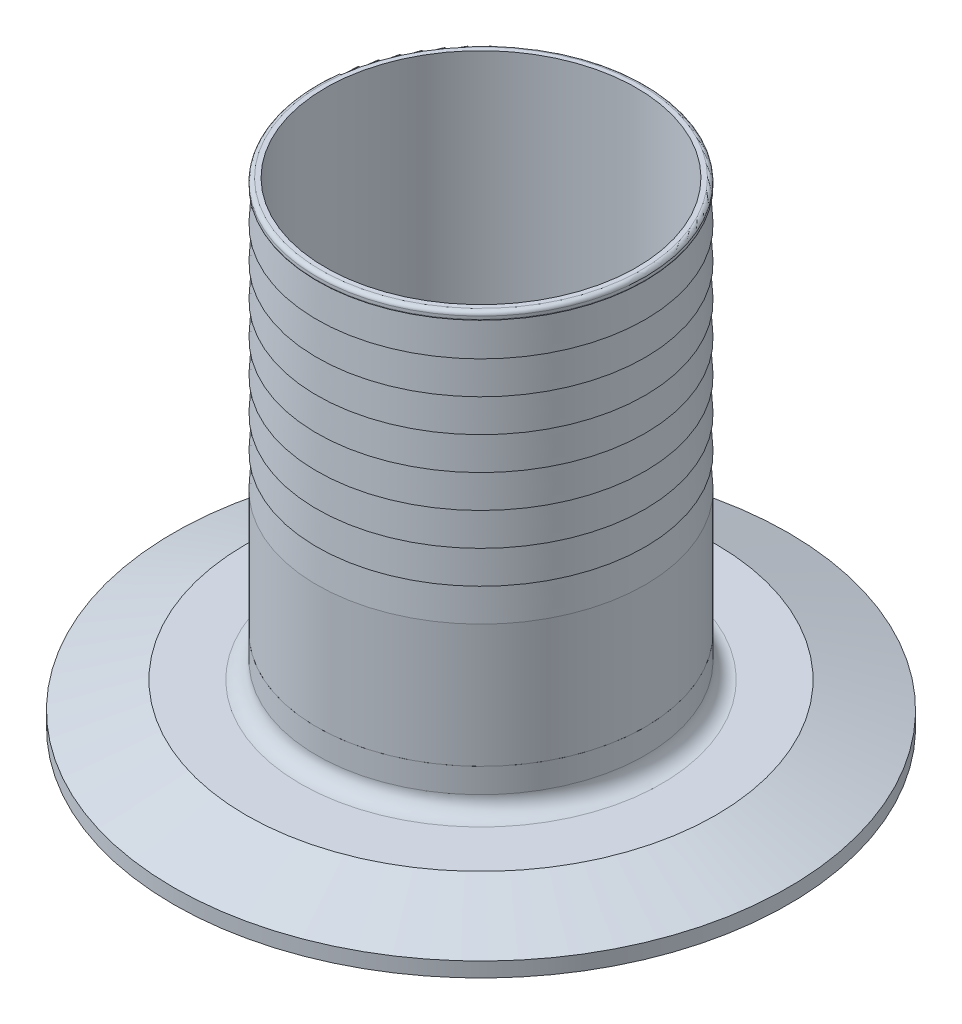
ISO-10303-21;
HEADER;
FILE_DESCRIPTION(('STEP AP214'),'2;1');
FILE_NAME('part.step','',(''),(''),'','','');
FILE_SCHEMA(('AUTOMOTIVE_DESIGN { 1 0 10303 214 1 1 1 1 }'));
ENDSEC;
DATA;
#1=APPLICATION_CONTEXT('core data for automotive mechanical design processes');
#2=APPLICATION_PROTOCOL_DEFINITION('international standard','automotive_design',2000,#1);
#3=PRODUCT_CONTEXT('',#1,'mechanical');
#4=PRODUCT('Part','Part','',(#3));
#5=PRODUCT_RELATED_PRODUCT_CATEGORY('part','',(#4));
#6=PRODUCT_DEFINITION_FORMATION('','',#4);
#7=PRODUCT_DEFINITION_CONTEXT('part definition',#1,'design');
#8=PRODUCT_DEFINITION('design','',#6,#7);
#9=PRODUCT_DEFINITION_SHAPE('','',#8);
#10=(LENGTH_UNIT() NAMED_UNIT(*) SI_UNIT(.MILLI.,.METRE.));
#11=(NAMED_UNIT(*) PLANE_ANGLE_UNIT() SI_UNIT($,.RADIAN.));
#12=(NAMED_UNIT(*) SI_UNIT($,.STERADIAN.) SOLID_ANGLE_UNIT());
#13=UNCERTAINTY_MEASURE_WITH_UNIT(LENGTH_MEASURE(1.E-05),#10,'distance_accuracy_value','');
#14=(GEOMETRIC_REPRESENTATION_CONTEXT(3) GLOBAL_UNCERTAINTY_ASSIGNED_CONTEXT((#13)) GLOBAL_UNIT_ASSIGNED_CONTEXT((#10,
#11,#12)) REPRESENTATION_CONTEXT('',''));
#15=CARTESIAN_POINT('',(0.,0.,0.));
#16=DIRECTION('',(0.,0.,1.));
#17=DIRECTION('',(1.,0.,0.));
#18=AXIS2_PLACEMENT_3D('',#15,#16,#17);
#19=CARTESIAN_POINT('',(89.1797478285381,79.9037281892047,85.2123361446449));
#20=DIRECTION('',(0.,-1.,0.));
#21=DIRECTION('',(0.0688647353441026,0.,-0.997626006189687));
#22=AXIS2_PLACEMENT_3D('',#19,#20,#21);
#23=PLANE('',#22);
#24=CARTESIAN_POINT('',(57.5051221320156,79.9037281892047,83.0258807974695));
#25=DIRECTION('',(0.,-1.,0.));
#26=DIRECTION('',(0.0688647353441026,0.,-0.997626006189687));
#27=AXIS2_PLACEMENT_3D('',#24,#25,#26);
#28=CIRCLE('',#27,30.099);
#29=CARTESIAN_POINT('',(59.5778818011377,79.9037281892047,52.9983356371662));
#30=VERTEX_POINT('',#29);
#31=EDGE_CURVE('P0_E85',#30,#30,#28,.T.);
#32=ORIENTED_EDGE('',*,*,#31,.F.);
#33=EDGE_LOOP('',(#32));
#34=FACE_BOUND('',#33,.T.);
#35=CARTESIAN_POINT('',(57.5051221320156,79.9037281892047,83.0258807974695));
#36=DIRECTION('',(0.,-1.,0.));
#37=DIRECTION('',(0.0688647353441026,0.,-0.997626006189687));
#38=AXIS2_PLACEMENT_3D('',#35,#36,#37);
#39=CIRCLE('',#38,31.75);
#40=CARTESIAN_POINT('',(59.6915774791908,79.9037281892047,51.351255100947));
#41=VERTEX_POINT('',#40);
#42=EDGE_CURVE('P0_E9',#41,#41,#39,.T.);
#43=ORIENTED_EDGE('',*,*,#42,.T.);
#44=EDGE_LOOP('',(#43));
#45=FACE_BOUND('',#44,.T.);
#46=ADVANCED_FACE('P0_F14',(#34,#45),#23,.T.);
#47=CARTESIAN_POINT('',(57.5051221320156,79.9037281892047,83.0258807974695));
#48=DIRECTION('',(0.,-1.,0.));
#49=DIRECTION('',(0.0688647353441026,0.,-0.997626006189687));
#50=AXIS2_PLACEMENT_3D('',#47,#48,#49);
#51=CYLINDRICAL_SURFACE('',#50,31.75);
#52=CARTESIAN_POINT('',(57.5051221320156,103.728928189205,83.0258807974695));
#53=DIRECTION('',(0.,-1.,0.));
#54=DIRECTION('',(0.0688647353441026,0.,-0.997626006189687));
#55=AXIS2_PLACEMENT_3D('',#52,#53,#54);
#56=CIRCLE('',#55,31.75);
#57=CARTESIAN_POINT('',(59.6915774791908,103.728928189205,51.351255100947));
#58=VERTEX_POINT('',#57);
#59=EDGE_CURVE('P0_E20',#58,#58,#56,.T.);
#60=ORIENTED_EDGE('',*,*,#59,.T.);
#61=EDGE_LOOP('',(#60));
#62=FACE_BOUND('',#61,.T.);
#63=ORIENTED_EDGE('',*,*,#42,.F.);
#64=EDGE_LOOP('',(#63));
#65=FACE_BOUND('',#64,.T.);
#66=ADVANCED_FACE('P0_F101',(#62,#65),#51,.T.);
#67=CARTESIAN_POINT('',(57.5051221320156,103.728928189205,83.0258807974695));
#68=DIRECTION('',(0.,-1.,0.));
#69=DIRECTION('',(0.0688647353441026,0.,-0.997626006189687));
#70=AXIS2_PLACEMENT_3D('',#67,#68,#69);
#71=CONICAL_SURFACE('',#70,31.75,0.0599281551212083);
#72=CARTESIAN_POINT('',(57.5051221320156,110.078928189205,83.0258807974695));
#73=DIRECTION('',(0.,-1.,0.));
#74=DIRECTION('',(0.0688647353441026,0.,-0.997626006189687));
#75=AXIS2_PLACEMENT_3D('',#72,#73,#74);
#76=CIRCLE('',#75,31.369);
#77=CARTESIAN_POINT('',(59.6653400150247,110.078928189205,51.7313506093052));
#78=VERTEX_POINT('',#77);
#79=EDGE_CURVE('P0_E24',#78,#78,#76,.T.);
#80=ORIENTED_EDGE('',*,*,#79,.T.);
#81=EDGE_LOOP('',(#80));
#82=FACE_BOUND('',#81,.T.);
#83=ORIENTED_EDGE('',*,*,#59,.F.);
#84=EDGE_LOOP('',(#83));
#85=FACE_BOUND('',#84,.T.);
#86=ADVANCED_FACE('P0_F106',(#82,#85),#71,.T.);
#87=CARTESIAN_POINT('',(89.1797478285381,110.078928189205,85.2123361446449));
#88=DIRECTION('',(0.,-1.,0.));
#89=DIRECTION('',(0.0688647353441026,0.,-0.997626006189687));
#90=AXIS2_PLACEMENT_3D('',#87,#88,#89);
#91=PLANE('',#90);
#92=CARTESIAN_POINT('',(57.5051221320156,110.078928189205,83.0258807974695));
#93=DIRECTION('',(0.,-1.,0.));
#94=DIRECTION('',(0.0688647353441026,0.,-0.997626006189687));
#95=AXIS2_PLACEMENT_3D('',#92,#93,#94);
#96=CIRCLE('',#95,31.75);
#97=CARTESIAN_POINT('',(59.6915774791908,110.078928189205,51.351255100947));
#98=VERTEX_POINT('',#97);
#99=EDGE_CURVE('P0_E28',#98,#98,#96,.T.);
#100=ORIENTED_EDGE('',*,*,#99,.T.);
#101=EDGE_LOOP('',(#100));
#102=FACE_BOUND('',#101,.T.);
#103=ORIENTED_EDGE('',*,*,#79,.F.);
#104=EDGE_LOOP('',(#103));
#105=FACE_BOUND('',#104,.T.);
#106=ADVANCED_FACE('P0_F110',(#102,#105),#91,.T.);
#107=CARTESIAN_POINT('',(57.5051221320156,110.078928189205,83.0258807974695));
#108=DIRECTION('',(0.,-1.,0.));
#109=DIRECTION('',(0.0688647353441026,0.,-0.997626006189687));
#110=AXIS2_PLACEMENT_3D('',#107,#108,#109);
#111=CONICAL_SURFACE('',#110,31.75,0.0599281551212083);
#112=CARTESIAN_POINT('',(57.5051221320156,116.428928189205,83.0258807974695));
#113=DIRECTION('',(0.,-1.,0.));
#114=DIRECTION('',(0.0688647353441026,0.,-0.997626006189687));
#115=AXIS2_PLACEMENT_3D('',#112,#113,#114);
#116=CIRCLE('',#115,31.369);
#117=CARTESIAN_POINT('',(59.6653400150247,116.428928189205,51.7313506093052));
#118=VERTEX_POINT('',#117);
#119=EDGE_CURVE('P0_E33',#118,#118,#116,.T.);
#120=ORIENTED_EDGE('',*,*,#119,.T.);
#121=EDGE_LOOP('',(#120));
#122=FACE_BOUND('',#121,.T.);
#123=ORIENTED_EDGE('',*,*,#99,.F.);
#124=EDGE_LOOP('',(#123));
#125=FACE_BOUND('',#124,.T.);
#126=ADVANCED_FACE('P0_F117',(#122,#125),#111,.T.);
#127=CARTESIAN_POINT('',(89.1797478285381,116.428928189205,85.2123361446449));
#128=DIRECTION('',(0.,-1.,0.));
#129=DIRECTION('',(0.0688647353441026,0.,-0.997626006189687));
#130=AXIS2_PLACEMENT_3D('',#127,#128,#129);
#131=PLANE('',#130);
#132=CARTESIAN_POINT('',(57.5051221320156,116.428928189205,83.0258807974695));
#133=DIRECTION('',(0.,-1.,0.));
#134=DIRECTION('',(0.0688647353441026,0.,-0.997626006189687));
#135=AXIS2_PLACEMENT_3D('',#132,#133,#134);
#136=CIRCLE('',#135,31.75);
#137=CARTESIAN_POINT('',(59.6915774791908,116.428928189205,51.351255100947));
#138=VERTEX_POINT('',#137);
#139=EDGE_CURVE('P0_E36',#138,#138,#136,.T.);
#140=ORIENTED_EDGE('',*,*,#139,.T.);
#141=EDGE_LOOP('',(#140));
#142=FACE_BOUND('',#141,.T.);
#143=ORIENTED_EDGE('',*,*,#119,.F.);
#144=EDGE_LOOP('',(#143));
#145=FACE_BOUND('',#144,.T.);
#146=ADVANCED_FACE('P0_F121',(#142,#145),#131,.T.);
#147=CARTESIAN_POINT('',(57.5051221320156,116.428928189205,83.0258807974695));
#148=DIRECTION('',(0.,-1.,0.));
#149=DIRECTION('',(0.0688647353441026,0.,-0.997626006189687));
#150=AXIS2_PLACEMENT_3D('',#147,#148,#149);
#151=CONICAL_SURFACE('',#150,31.75,0.0599281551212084);
#152=CARTESIAN_POINT('',(57.5051221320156,122.778928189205,83.0258807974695));
#153=DIRECTION('',(0.,-1.,0.));
#154=DIRECTION('',(0.0688647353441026,0.,-0.997626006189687));
#155=AXIS2_PLACEMENT_3D('',#152,#153,#154);
#156=CIRCLE('',#155,31.369);
#157=CARTESIAN_POINT('',(59.6653400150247,122.778928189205,51.7313506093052));
#158=VERTEX_POINT('',#157);
#159=EDGE_CURVE('P0_E39',#158,#158,#156,.T.);
#160=ORIENTED_EDGE('',*,*,#159,.T.);
#161=EDGE_LOOP('',(#160));
#162=FACE_BOUND('',#161,.T.);
#163=ORIENTED_EDGE('',*,*,#139,.F.);
#164=EDGE_LOOP('',(#163));
#165=FACE_BOUND('',#164,.T.);
#166=ADVANCED_FACE('P0_F125',(#162,#165),#151,.T.);
#167=CARTESIAN_POINT('',(89.1797478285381,122.778928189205,85.2123361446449));
#168=DIRECTION('',(0.,-1.,0.));
#169=DIRECTION('',(0.0688647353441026,0.,-0.997626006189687));
#170=AXIS2_PLACEMENT_3D('',#167,#168,#169);
#171=PLANE('',#170);
#172=CARTESIAN_POINT('',(57.5051221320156,122.778928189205,83.0258807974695));
#173=DIRECTION('',(0.,-1.,0.));
#174=DIRECTION('',(0.0688647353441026,0.,-0.997626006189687));
#175=AXIS2_PLACEMENT_3D('',#172,#173,#174);
#176=CIRCLE('',#175,31.75);
#177=CARTESIAN_POINT('',(59.6915774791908,122.778928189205,51.351255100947));
#178=VERTEX_POINT('',#177);
#179=EDGE_CURVE('P0_E42',#178,#178,#176,.T.);
#180=ORIENTED_EDGE('',*,*,#179,.T.);
#181=EDGE_LOOP('',(#180));
#182=FACE_BOUND('',#181,.T.);
#183=ORIENTED_EDGE('',*,*,#159,.F.);
#184=EDGE_LOOP('',(#183));
#185=FACE_BOUND('',#184,.T.);
#186=ADVANCED_FACE('P0_F129',(#182,#185),#171,.T.);
#187=CARTESIAN_POINT('',(57.5051221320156,122.778928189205,83.0258807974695));
#188=DIRECTION('',(0.,-1.,0.));
#189=DIRECTION('',(0.0688647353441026,0.,-0.997626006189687));
#190=AXIS2_PLACEMENT_3D('',#187,#188,#189);
#191=CONICAL_SURFACE('',#190,31.75,0.0599281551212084);
#192=CARTESIAN_POINT('',(57.5051221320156,129.128928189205,83.0258807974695));
#193=DIRECTION('',(0.,-1.,0.));
#194=DIRECTION('',(0.0688647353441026,0.,-0.997626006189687));
#195=AXIS2_PLACEMENT_3D('',#192,#193,#194);
#196=CIRCLE('',#195,31.369);
#197=CARTESIAN_POINT('',(59.6653400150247,129.128928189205,51.7313506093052));
#198=VERTEX_POINT('',#197);
#199=EDGE_CURVE('P0_E45',#198,#198,#196,.T.);
#200=ORIENTED_EDGE('',*,*,#199,.T.);
#201=EDGE_LOOP('',(#200));
#202=FACE_BOUND('',#201,.T.);
#203=ORIENTED_EDGE('',*,*,#179,.F.);
#204=EDGE_LOOP('',(#203));
#205=FACE_BOUND('',#204,.T.);
#206=ADVANCED_FACE('P0_F133',(#202,#205),#191,.T.);
#207=CARTESIAN_POINT('',(89.1797478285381,129.128928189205,85.2123361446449));
#208=DIRECTION('',(0.,-1.,0.));
#209=DIRECTION('',(0.0688647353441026,0.,-0.997626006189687));
#210=AXIS2_PLACEMENT_3D('',#207,#208,#209);
#211=PLANE('',#210);
#212=CARTESIAN_POINT('',(57.5051221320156,129.128928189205,83.0258807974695));
#213=DIRECTION('',(0.,-1.,0.));
#214=DIRECTION('',(0.0688647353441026,0.,-0.997626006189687));
#215=AXIS2_PLACEMENT_3D('',#212,#213,#214);
#216=CIRCLE('',#215,31.75);
#217=CARTESIAN_POINT('',(59.6915774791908,129.128928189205,51.351255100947));
#218=VERTEX_POINT('',#217);
#219=EDGE_CURVE('P0_E48',#218,#218,#216,.T.);
#220=ORIENTED_EDGE('',*,*,#219,.T.);
#221=EDGE_LOOP('',(#220));
#222=FACE_BOUND('',#221,.T.);
#223=ORIENTED_EDGE('',*,*,#199,.F.);
#224=EDGE_LOOP('',(#223));
#225=FACE_BOUND('',#224,.T.);
#226=ADVANCED_FACE('P0_F137',(#222,#225),#211,.T.);
#227=CARTESIAN_POINT('',(57.5051221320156,129.128928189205,83.0258807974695));
#228=DIRECTION('',(0.,-1.,0.));
#229=DIRECTION('',(0.0688647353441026,0.,-0.997626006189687));
#230=AXIS2_PLACEMENT_3D('',#227,#228,#229);
#231=CONICAL_SURFACE('',#230,31.75,0.0599281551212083);
#232=CARTESIAN_POINT('',(57.5051221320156,135.478928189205,83.0258807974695));
#233=DIRECTION('',(0.,-1.,0.));
#234=DIRECTION('',(0.0688647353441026,0.,-0.997626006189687));
#235=AXIS2_PLACEMENT_3D('',#232,#233,#234);
#236=CIRCLE('',#235,31.369);
#237=CARTESIAN_POINT('',(59.6653400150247,135.478928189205,51.7313506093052));
#238=VERTEX_POINT('',#237);
#239=EDGE_CURVE('P0_E51',#238,#238,#236,.T.);
#240=ORIENTED_EDGE('',*,*,#239,.T.);
#241=EDGE_LOOP('',(#240));
#242=FACE_BOUND('',#241,.T.);
#243=ORIENTED_EDGE('',*,*,#219,.F.);
#244=EDGE_LOOP('',(#243));
#245=FACE_BOUND('',#244,.T.);
#246=ADVANCED_FACE('P0_F141',(#242,#245),#231,.T.);
#247=CARTESIAN_POINT('',(89.1797478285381,135.478928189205,85.2123361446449));
#248=DIRECTION('',(0.,-1.,0.));
#249=DIRECTION('',(0.0688647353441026,0.,-0.997626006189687));
#250=AXIS2_PLACEMENT_3D('',#247,#248,#249);
#251=PLANE('',#250);
#252=CARTESIAN_POINT('',(57.5051221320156,135.478928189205,83.0258807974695));
#253=DIRECTION('',(0.,-1.,0.));
#254=DIRECTION('',(0.0688647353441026,0.,-0.997626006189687));
#255=AXIS2_PLACEMENT_3D('',#252,#253,#254);
#256=CIRCLE('',#255,31.75);
#257=CARTESIAN_POINT('',(59.6915774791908,135.478928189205,51.351255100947));
#258=VERTEX_POINT('',#257);
#259=EDGE_CURVE('P0_E54',#258,#258,#256,.T.);
#260=ORIENTED_EDGE('',*,*,#259,.T.);
#261=EDGE_LOOP('',(#260));
#262=FACE_BOUND('',#261,.T.);
#263=ORIENTED_EDGE('',*,*,#239,.F.);
#264=EDGE_LOOP('',(#263));
#265=FACE_BOUND('',#264,.T.);
#266=ADVANCED_FACE('P0_F145',(#262,#265),#251,.T.);
#267=CARTESIAN_POINT('',(57.5051221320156,135.478928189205,83.0258807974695));
#268=DIRECTION('',(0.,-1.,0.));
#269=DIRECTION('',(0.0688647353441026,0.,-0.997626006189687));
#270=AXIS2_PLACEMENT_3D('',#267,#268,#269);
#271=CONICAL_SURFACE('',#270,31.75,0.0599281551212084);
#272=CARTESIAN_POINT('',(57.5051221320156,141.828928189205,83.0258807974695));
#273=DIRECTION('',(0.,-1.,0.));
#274=DIRECTION('',(0.0688647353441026,0.,-0.997626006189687));
#275=AXIS2_PLACEMENT_3D('',#272,#273,#274);
#276=CIRCLE('',#275,31.369);
#277=CARTESIAN_POINT('',(59.6653400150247,141.828928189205,51.7313506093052));
#278=VERTEX_POINT('',#277);
#279=EDGE_CURVE('P0_E57',#278,#278,#276,.T.);
#280=ORIENTED_EDGE('',*,*,#279,.T.);
#281=EDGE_LOOP('',(#280));
#282=FACE_BOUND('',#281,.T.);
#283=ORIENTED_EDGE('',*,*,#259,.F.);
#284=EDGE_LOOP('',(#283));
#285=FACE_BOUND('',#284,.T.);
#286=ADVANCED_FACE('P0_F149',(#282,#285),#271,.T.);
#287=CARTESIAN_POINT('',(89.1797478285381,141.828928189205,85.2123361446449));
#288=DIRECTION('',(0.,-1.,0.));
#289=DIRECTION('',(0.0688647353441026,0.,-0.997626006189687));
#290=AXIS2_PLACEMENT_3D('',#287,#288,#289);
#291=PLANE('',#290);
#292=CARTESIAN_POINT('',(57.5051221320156,141.828928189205,83.0258807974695));
#293=DIRECTION('',(0.,-1.,0.));
#294=DIRECTION('',(0.0688647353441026,0.,-0.997626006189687));
#295=AXIS2_PLACEMENT_3D('',#292,#293,#294);
#296=CIRCLE('',#295,31.75);
#297=CARTESIAN_POINT('',(59.6915774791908,141.828928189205,51.351255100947));
#298=VERTEX_POINT('',#297);
#299=EDGE_CURVE('P0_E60',#298,#298,#296,.T.);
#300=ORIENTED_EDGE('',*,*,#299,.T.);
#301=EDGE_LOOP('',(#300));
#302=FACE_BOUND('',#301,.T.);
#303=ORIENTED_EDGE('',*,*,#279,.F.);
#304=EDGE_LOOP('',(#303));
#305=FACE_BOUND('',#304,.T.);
#306=ADVANCED_FACE('P0_F153',(#302,#305),#291,.T.);
#307=CARTESIAN_POINT('',(57.5051221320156,141.828928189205,83.0258807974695));
#308=DIRECTION('',(0.,-1.,0.));
#309=DIRECTION('',(0.0688647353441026,0.,-0.997626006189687));
#310=AXIS2_PLACEMENT_3D('',#307,#308,#309);
#311=CONICAL_SURFACE('',#310,31.75,0.0599281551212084);
#312=CARTESIAN_POINT('',(57.5051221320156,148.178928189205,83.0258807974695));
#313=DIRECTION('',(0.,-1.,0.));
#314=DIRECTION('',(0.0688647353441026,0.,-0.997626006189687));
#315=AXIS2_PLACEMENT_3D('',#312,#313,#314);
#316=CIRCLE('',#315,31.369);
#317=CARTESIAN_POINT('',(59.6653400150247,148.178928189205,51.7313506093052));
#318=VERTEX_POINT('',#317);
#319=EDGE_CURVE('P0_E63',#318,#318,#316,.T.);
#320=ORIENTED_EDGE('',*,*,#319,.T.);
#321=EDGE_LOOP('',(#320));
#322=FACE_BOUND('',#321,.T.);
#323=ORIENTED_EDGE('',*,*,#299,.F.);
#324=EDGE_LOOP('',(#323));
#325=FACE_BOUND('',#324,.T.);
#326=ADVANCED_FACE('P0_F157',(#322,#325),#311,.T.);
#327=CARTESIAN_POINT('',(89.1797478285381,148.178928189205,85.2123361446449));
#328=DIRECTION('',(0.,-1.,0.));
#329=DIRECTION('',(0.0688647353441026,0.,-0.997626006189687));
#330=AXIS2_PLACEMENT_3D('',#327,#328,#329);
#331=PLANE('',#330);
#332=CARTESIAN_POINT('',(57.5051221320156,148.178928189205,83.0258807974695));
#333=DIRECTION('',(0.,-1.,0.));
#334=DIRECTION('',(0.0688647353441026,0.,-0.997626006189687));
#335=AXIS2_PLACEMENT_3D('',#332,#333,#334);
#336=CIRCLE('',#335,31.75);
#337=CARTESIAN_POINT('',(59.6915774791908,148.178928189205,51.351255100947));
#338=VERTEX_POINT('',#337);
#339=EDGE_CURVE('P0_E66',#338,#338,#336,.T.);
#340=ORIENTED_EDGE('',*,*,#339,.T.);
#341=EDGE_LOOP('',(#340));
#342=FACE_BOUND('',#341,.T.);
#343=ORIENTED_EDGE('',*,*,#319,.F.);
#344=EDGE_LOOP('',(#343));
#345=FACE_BOUND('',#344,.T.);
#346=ADVANCED_FACE('P0_F161',(#342,#345),#331,.T.);
#347=CARTESIAN_POINT('',(57.5051221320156,148.178928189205,83.0258807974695));
#348=DIRECTION('',(0.,-1.,0.));
#349=DIRECTION('',(0.0688647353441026,0.,-0.997626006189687));
#350=AXIS2_PLACEMENT_3D('',#347,#348,#349);
#351=CONICAL_SURFACE('',#350,31.75,0.0599281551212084);
#352=CARTESIAN_POINT('',(57.5051221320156,154.528928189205,83.0258807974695));
#353=DIRECTION('',(0.,-1.,0.));
#354=DIRECTION('',(0.0688647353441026,0.,-0.997626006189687));
#355=AXIS2_PLACEMENT_3D('',#352,#353,#354);
#356=CIRCLE('',#355,31.369);
#357=CARTESIAN_POINT('',(59.6653400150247,154.528928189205,51.7313506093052));
#358=VERTEX_POINT('',#357);
#359=EDGE_CURVE('P0_E69',#358,#358,#356,.T.);
#360=ORIENTED_EDGE('',*,*,#359,.T.);
#361=EDGE_LOOP('',(#360));
#362=FACE_BOUND('',#361,.T.);
#363=ORIENTED_EDGE('',*,*,#339,.F.);
#364=EDGE_LOOP('',(#363));
#365=FACE_BOUND('',#364,.T.);
#366=ADVANCED_FACE('P0_F165',(#362,#365),#351,.T.);
#367=CARTESIAN_POINT('',(88.926350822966,154.528928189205,85.1948445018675));
#368=DIRECTION('',(0.,-1.,0.));
#369=DIRECTION('',(0.0688647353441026,0.,-0.997626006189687));
#370=AXIS2_PLACEMENT_3D('',#367,#368,#369);
#371=PLANE('',#370);
#372=CARTESIAN_POINT('',(57.5051221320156,154.528928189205,83.0258807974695));
#373=DIRECTION('',(0.,-1.,0.));
#374=DIRECTION('',(0.0688647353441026,0.,-0.997626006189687));
#375=AXIS2_PLACEMENT_3D('',#372,#373,#374);
#376=CIRCLE('',#375,31.496);
#377=CARTESIAN_POINT('',(59.6740858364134,154.528928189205,51.6046521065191));
#378=VERTEX_POINT('',#377);
#379=EDGE_CURVE('P0_E72',#378,#378,#376,.T.);
#380=ORIENTED_EDGE('',*,*,#379,.T.);
#381=EDGE_LOOP('',(#380));
#382=FACE_BOUND('',#381,.T.);
#383=ORIENTED_EDGE('',*,*,#359,.F.);
#384=EDGE_LOOP('',(#383));
#385=FACE_BOUND('',#384,.T.);
#386=ADVANCED_FACE('P0_F169',(#382,#385),#371,.T.);
#387=CARTESIAN_POINT('',(57.5051221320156,154.782928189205,83.0258807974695));
#388=DIRECTION('',(0.,-1.,0.));
#389=DIRECTION('',(0.0688647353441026,0.,-0.997626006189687));
#390=AXIS2_PLACEMENT_3D('',#387,#388,#389);
#391=TOROIDAL_SURFACE('',#390,31.496,0.254000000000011);
#392=CARTESIAN_POINT('',(57.5051221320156,154.782928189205,83.0258807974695));
#393=DIRECTION('',(0.,-1.,0.));
#394=DIRECTION('',(0.0688647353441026,0.,-0.997626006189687));
#395=AXIS2_PLACEMENT_3D('',#392,#393,#394);
#396=CIRCLE('',#395,31.75);
#397=CARTESIAN_POINT('',(59.6915774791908,154.782928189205,51.351255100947));
#398=VERTEX_POINT('',#397);
#399=EDGE_CURVE('P0_E75',#398,#398,#396,.T.);
#400=ORIENTED_EDGE('',*,*,#399,.T.);
#401=EDGE_LOOP('',(#400));
#402=FACE_BOUND('',#401,.T.);
#403=ORIENTED_EDGE('',*,*,#379,.F.);
#404=EDGE_LOOP('',(#403));
#405=FACE_BOUND('',#404,.T.);
#406=ADVANCED_FACE('P0_F173',(#402,#405),#391,.T.);
#407=CARTESIAN_POINT('',(57.5051221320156,79.9037281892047,83.0258807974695));
#408=DIRECTION('',(0.,-1.,0.));
#409=DIRECTION('',(0.0688647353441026,0.,-0.997626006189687));
#410=AXIS2_PLACEMENT_3D('',#407,#408,#409);
#411=CYLINDRICAL_SURFACE('',#410,31.75);
#412=CARTESIAN_POINT('',(57.5051221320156,155.341728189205,83.0258807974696));
#413=DIRECTION('',(0.,-1.,0.));
#414=DIRECTION('',(0.0688647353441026,0.,-0.997626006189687));
#415=AXIS2_PLACEMENT_3D('',#412,#413,#414);
#416=CIRCLE('',#415,31.75);
#417=CARTESIAN_POINT('',(59.6915774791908,155.341728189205,51.351255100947));
#418=VERTEX_POINT('',#417);
#419=EDGE_CURVE('P0_E78',#418,#418,#416,.T.);
#420=ORIENTED_EDGE('',*,*,#419,.T.);
#421=EDGE_LOOP('',(#420));
#422=FACE_BOUND('',#421,.T.);
#423=ORIENTED_EDGE('',*,*,#399,.F.);
#424=EDGE_LOOP('',(#423));
#425=FACE_BOUND('',#424,.T.);
#426=ADVANCED_FACE('P0_F177',(#422,#425),#411,.T.);
#427=CARTESIAN_POINT('',(57.5051221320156,155.341728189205,83.0258807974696));
#428=DIRECTION('',(0.,-1.,0.));
#429=DIRECTION('',(0.0688647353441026,0.,-0.997626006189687));
#430=AXIS2_PLACEMENT_3D('',#427,#428,#429);
#431=TOROIDAL_SURFACE('',#430,30.988,0.761999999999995);
#432=CARTESIAN_POINT('',(57.5051221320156,156.103728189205,83.0258807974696));
#433=DIRECTION('',(0.,-1.,0.));
#434=DIRECTION('',(0.0688647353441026,0.,-0.997626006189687));
#435=AXIS2_PLACEMENT_3D('',#432,#433,#434);
#436=CIRCLE('',#435,30.988);
#437=CARTESIAN_POINT('',(59.6391025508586,156.103728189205,52.1114461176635));
#438=VERTEX_POINT('',#437);
#439=EDGE_CURVE('P0_E81',#438,#438,#436,.T.);
#440=ORIENTED_EDGE('',*,*,#439,.T.);
#441=EDGE_LOOP('',(#440));
#442=FACE_BOUND('',#441,.T.);
#443=ORIENTED_EDGE('',*,*,#419,.F.);
#444=EDGE_LOOP('',(#443));
#445=FACE_BOUND('',#444,.T.);
#446=ADVANCED_FACE('P0_F181',(#442,#445),#431,.T.);
#447=CARTESIAN_POINT('',(57.5051221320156,156.103728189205,83.0258807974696));
#448=DIRECTION('',(0.,1.,0.));
#449=DIRECTION('',(-0.0688647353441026,0.,0.997626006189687));
#450=AXIS2_PLACEMENT_3D('',#447,#448,#449);
#451=PLANE('',#450);
#452=CARTESIAN_POINT('',(57.5051221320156,156.103728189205,83.0258807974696));
#453=DIRECTION('',(0.,-1.,0.));
#454=DIRECTION('',(0.0688647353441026,0.,-0.997626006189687));
#455=AXIS2_PLACEMENT_3D('',#452,#453,#454);
#456=CIRCLE('',#455,30.099);
#457=CARTESIAN_POINT('',(59.5778818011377,156.103728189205,52.9983356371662));
#458=VERTEX_POINT('',#457);
#459=EDGE_CURVE('P0_E84',#458,#458,#456,.T.);
#460=ORIENTED_EDGE('',*,*,#459,.T.);
#461=EDGE_LOOP('',(#460));
#462=FACE_BOUND('',#461,.T.);
#463=ORIENTED_EDGE('',*,*,#439,.F.);
#464=EDGE_LOOP('',(#463));
#465=FACE_BOUND('',#464,.T.);
#466=ADVANCED_FACE('P0_F91',(#462,#465),#451,.T.);
#467=CARTESIAN_POINT('',(57.5051221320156,156.103728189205,83.0258807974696));
#468=DIRECTION('',(0.,-1.,0.));
#469=DIRECTION('',(0.0688647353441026,0.,-0.997626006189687));
#470=AXIS2_PLACEMENT_3D('',#467,#468,#469);
#471=CYLINDRICAL_SURFACE('',#470,30.099);
#472=CARTESIAN_POINT('',(59.5778818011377,156.103728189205,52.9983356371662));
#473=CARTESIAN_POINT('',(59.5778818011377,155.309978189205,52.9983356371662));
#474=CARTESIAN_POINT('',(59.5778818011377,154.516228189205,52.9983356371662));
#475=CARTESIAN_POINT('',(59.5778818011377,152.928728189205,52.9983356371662));
#476=CARTESIAN_POINT('',(59.5778818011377,152.134978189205,52.9983356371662));
#477=CARTESIAN_POINT('',(59.5778818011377,150.547478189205,52.9983356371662));
#478=CARTESIAN_POINT('',(59.5778818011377,149.753728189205,52.9983356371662));
#479=CARTESIAN_POINT('',(59.5778818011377,148.166228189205,52.9983356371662));
#480=CARTESIAN_POINT('',(59.5778818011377,147.372478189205,52.9983356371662));
#481=CARTESIAN_POINT('',(59.5778818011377,145.784978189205,52.9983356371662));
#482=CARTESIAN_POINT('',(59.5778818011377,144.991228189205,52.9983356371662));
#483=CARTESIAN_POINT('',(59.5778818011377,143.403728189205,52.9983356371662));
#484=CARTESIAN_POINT('',(59.5778818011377,142.609978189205,52.9983356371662));
#485=CARTESIAN_POINT('',(59.5778818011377,141.022478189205,52.9983356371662));
#486=CARTESIAN_POINT('',(59.5778818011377,140.228728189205,52.9983356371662));
#487=CARTESIAN_POINT('',(59.5778818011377,138.641228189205,52.9983356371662));
#488=CARTESIAN_POINT('',(59.5778818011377,137.847478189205,52.9983356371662));
#489=CARTESIAN_POINT('',(59.5778818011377,136.259978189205,52.9983356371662));
#490=CARTESIAN_POINT('',(59.5778818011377,135.466228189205,52.9983356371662));
#491=CARTESIAN_POINT('',(59.5778818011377,133.878728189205,52.9983356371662));
#492=CARTESIAN_POINT('',(59.5778818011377,133.084978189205,52.9983356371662));
#493=CARTESIAN_POINT('',(59.5778818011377,131.497478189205,52.9983356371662));
#494=CARTESIAN_POINT('',(59.5778818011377,130.703728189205,52.9983356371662));
#495=CARTESIAN_POINT('',(59.5778818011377,129.116228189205,52.9983356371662));
#496=CARTESIAN_POINT('',(59.5778818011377,128.322478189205,52.9983356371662));
#497=CARTESIAN_POINT('',(59.5778818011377,126.734978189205,52.9983356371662));
#498=CARTESIAN_POINT('',(59.5778818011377,125.941228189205,52.9983356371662));
#499=CARTESIAN_POINT('',(59.5778818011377,124.353728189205,52.9983356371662));
#500=CARTESIAN_POINT('',(59.5778818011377,123.559978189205,52.9983356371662));
#501=CARTESIAN_POINT('',(59.5778818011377,121.972478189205,52.9983356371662));
#502=CARTESIAN_POINT('',(59.5778818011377,121.178728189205,52.9983356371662));
#503=CARTESIAN_POINT('',(59.5778818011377,119.591228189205,52.9983356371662));
#504=CARTESIAN_POINT('',(59.5778818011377,118.797478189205,52.9983356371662));
#505=CARTESIAN_POINT('',(59.5778818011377,117.209978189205,52.9983356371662));
#506=CARTESIAN_POINT('',(59.5778818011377,116.416228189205,52.9983356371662));
#507=CARTESIAN_POINT('',(59.5778818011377,114.828728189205,52.9983356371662));
#508=CARTESIAN_POINT('',(59.5778818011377,114.034978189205,52.9983356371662));
#509=CARTESIAN_POINT('',(59.5778818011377,112.447478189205,52.9983356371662));
#510=CARTESIAN_POINT('',(59.5778818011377,111.653728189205,52.9983356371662));
#511=CARTESIAN_POINT('',(59.5778818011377,110.066228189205,52.9983356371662));
#512=CARTESIAN_POINT('',(59.5778818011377,109.272478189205,52.9983356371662));
#513=CARTESIAN_POINT('',(59.5778818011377,107.684978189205,52.9983356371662));
#514=CARTESIAN_POINT('',(59.5778818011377,106.891228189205,52.9983356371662));
#515=CARTESIAN_POINT('',(59.5778818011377,105.303728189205,52.9983356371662));
#516=CARTESIAN_POINT('',(59.5778818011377,104.509978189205,52.9983356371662));
#517=CARTESIAN_POINT('',(59.5778818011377,102.922478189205,52.9983356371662));
#518=CARTESIAN_POINT('',(59.5778818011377,102.128728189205,52.9983356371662));
#519=CARTESIAN_POINT('',(59.5778818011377,100.541228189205,52.9983356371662));
#520=CARTESIAN_POINT('',(59.5778818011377,99.7474781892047,52.9983356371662));
#521=CARTESIAN_POINT('',(59.5778818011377,98.1599781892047,52.9983356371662));
#522=CARTESIAN_POINT('',(59.5778818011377,97.3662281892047,52.9983356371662));
#523=CARTESIAN_POINT('',(59.5778818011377,95.7787281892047,52.9983356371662));
#524=CARTESIAN_POINT('',(59.5778818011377,94.9849781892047,52.9983356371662));
#525=CARTESIAN_POINT('',(59.5778818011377,93.3974781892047,52.9983356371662));
#526=CARTESIAN_POINT('',(59.5778818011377,92.6037281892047,52.9983356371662));
#527=CARTESIAN_POINT('',(59.5778818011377,91.0162281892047,52.9983356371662));
#528=CARTESIAN_POINT('',(59.5778818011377,90.2224781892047,52.9983356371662));
#529=CARTESIAN_POINT('',(59.5778818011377,88.6349781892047,52.9983356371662));
#530=CARTESIAN_POINT('',(59.5778818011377,87.8412281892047,52.9983356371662));
#531=CARTESIAN_POINT('',(59.5778818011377,86.2537281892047,52.9983356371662));
#532=CARTESIAN_POINT('',(59.5778818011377,85.4599781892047,52.9983356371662));
#533=CARTESIAN_POINT('',(59.5778818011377,83.8724781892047,52.9983356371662));
#534=CARTESIAN_POINT('',(59.5778818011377,83.0787281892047,52.9983356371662));
#535=CARTESIAN_POINT('',(59.5778818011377,81.4912281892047,52.9983356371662));
#536=CARTESIAN_POINT('',(59.5778818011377,80.6974781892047,52.9983356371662));
#537=CARTESIAN_POINT('',(59.5778818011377,79.9037281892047,52.9983356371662));
#538=B_SPLINE_CURVE_WITH_KNOTS('',3,(#472,#473,#474,#475,#476,#477,#478,#479,#480,#481,#482,
#483,#484,#485,#486,#487,#488,#489,#490,#491,#492,#493,#494,#495,#496,#497,#498,#499,#500,#501,
#502,#503,#504,#505,#506,#507,#508,#509,#510,#511,#512,#513,#514,#515,#516,#517,#518,#519,#520,
#521,#522,#523,#524,#525,#526,#527,#528,#529,#530,#531,#532,#533,#534,#535,#536,#537),
.UNSPECIFIED.,.F.,.F.,(4,2,2,2,2,2,2,2,2,2,2,2,2,2,2,2,2,2,2,2,2,2,2,2,2,2,2,2,2,2,2,2,4),(0.,
2.38125,4.7625,7.14375,9.52500000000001,11.90625,14.2875,16.66875,19.05,21.43125,23.8125,
26.19375,28.575,30.95625,33.3375,35.71875,38.1,40.48125,42.8625,45.24375,47.625,50.00625,
52.3875,54.76875,57.15,59.53125,61.9125,64.29375,66.675,69.05625,71.4375,73.81875,76.2),.UNSPECIFIED.);
#539=EDGE_CURVE('P0_BSEAM94',#458,#30,#538,.T.);
#540=ORIENTED_EDGE('',*,*,#459,.F.);
#541=ORIENTED_EDGE('',*,*,#31,.T.);
#542=ORIENTED_EDGE('',*,*,#539,.T.);
#543=ORIENTED_EDGE('',*,*,#539,.F.);
#544=EDGE_LOOP('',(#540,#542,#541,#543));
#545=FACE_BOUND('',#544,.T.);
#546=ADVANCED_FACE('P0_F94',(#545),#471,.F.);
#547=CLOSED_SHELL('',(#46,#66,#86,#106,#126,#146,#166,#186,#206,#226,#246,#266,#286,#306,#326,
#346,#366,#386,#406,#426,#446,#466,#546));
#548=MANIFOLD_SOLID_BREP('P0_B1',#547);
#549=CARTESIAN_POINT('',(27.4061221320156,79.9037281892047,83.0258807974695));
#550=DIRECTION('',(0.,-1.,0.));
#551=DIRECTION('',(0.,0.,-1.));
#552=AXIS2_PLACEMENT_3D('',#549,#550,#551);
#553=PLANE('',#552);
#554=CARTESIAN_POINT('',(57.5051221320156,79.9037281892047,83.0258807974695));
#555=DIRECTION('',(0.,-1.,0.));
#556=DIRECTION('',(0.,0.,-1.));
#557=AXIS2_PLACEMENT_3D('',#554,#555,#556);
#558=CIRCLE('',#557,31.75);
#559=CARTESIAN_POINT('',(57.5051221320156,79.9037281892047,51.2758807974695));
#560=VERTEX_POINT('',#559);
#561=EDGE_CURVE('P1_E10',#560,#560,#558,.T.);
#562=ORIENTED_EDGE('',*,*,#561,.F.);
#563=EDGE_LOOP('',(#562));
#564=FACE_BOUND('',#563,.T.);
#565=CARTESIAN_POINT('',(57.5051221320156,79.9037281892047,83.0258807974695));
#566=DIRECTION('',(0.,-1.,0.));
#567=DIRECTION('',(0.,0.,-1.));
#568=AXIS2_PLACEMENT_3D('',#565,#566,#567);
#569=CIRCLE('',#568,30.099);
#570=CARTESIAN_POINT('',(57.5051221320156,79.9037281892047,52.9268807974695));
#571=VERTEX_POINT('',#570);
#572=EDGE_CURVE('P1_E64',#571,#571,#569,.T.);
#573=ORIENTED_EDGE('',*,*,#572,.T.);
#574=EDGE_LOOP('',(#573));
#575=FACE_BOUND('',#574,.T.);
#576=ADVANCED_FACE('P1_F15',(#564,#575),#553,.F.);
#577=CARTESIAN_POINT('',(57.5051221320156,64.0287281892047,83.0258807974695));
#578=DIRECTION('',(0.,-1.,0.));
#579=DIRECTION('',(0.,0.,-1.));
#580=AXIS2_PLACEMENT_3D('',#577,#578,#579);
#581=CYLINDRICAL_SURFACE('',#580,31.75);
#582=CARTESIAN_POINT('',(57.5051221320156,75.1539281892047,83.0258807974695));
#583=DIRECTION('',(0.,-1.,0.));
#584=DIRECTION('',(0.,0.,-1.));
#585=AXIS2_PLACEMENT_3D('',#582,#583,#584);
#586=CIRCLE('',#585,31.75);
#587=CARTESIAN_POINT('',(57.5051221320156,75.1539281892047,51.2758807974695));
#588=VERTEX_POINT('',#587);
#589=EDGE_CURVE('P1_E21',#588,#588,#586,.T.);
#590=ORIENTED_EDGE('',*,*,#589,.F.);
#591=EDGE_LOOP('',(#590));
#592=FACE_BOUND('',#591,.T.);
#593=ORIENTED_EDGE('',*,*,#561,.T.);
#594=EDGE_LOOP('',(#593));
#595=FACE_BOUND('',#594,.T.);
#596=ADVANCED_FACE('P1_F143',(#592,#595),#581,.T.);
#597=CARTESIAN_POINT('',(57.5051221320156,75.1539281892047,83.0258807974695));
#598=DIRECTION('',(0.,-1.,0.));
#599=DIRECTION('',(0.,0.,-1.));
#600=AXIS2_PLACEMENT_3D('',#597,#598,#599);
#601=TOROIDAL_SURFACE('',#600,34.925,3.175);
#602=CARTESIAN_POINT('',(57.5051221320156,71.9789281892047,83.0258807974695));
#603=DIRECTION('',(0.,-1.,0.));
#604=DIRECTION('',(0.,0.,-1.));
#605=AXIS2_PLACEMENT_3D('',#602,#603,#604);
#606=CIRCLE('',#605,34.925);
#607=CARTESIAN_POINT('',(57.5051221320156,71.9789281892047,48.1008807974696));
#608=VERTEX_POINT('',#607);
#609=EDGE_CURVE('P1_E25',#608,#608,#606,.T.);
#610=ORIENTED_EDGE('',*,*,#609,.F.);
#611=EDGE_LOOP('',(#610));
#612=FACE_BOUND('',#611,.T.);
#613=ORIENTED_EDGE('',*,*,#589,.T.);
#614=EDGE_LOOP('',(#613));
#615=FACE_BOUND('',#614,.T.);
#616=ADVANCED_FACE('P1_F138',(#612,#615),#601,.F.);
#617=CARTESIAN_POINT('',(22.5801221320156,71.9789281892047,83.0258807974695));
#618=DIRECTION('',(0.,-1.,0.));
#619=DIRECTION('',(0.,0.,-1.));
#620=AXIS2_PLACEMENT_3D('',#617,#618,#619);
#621=PLANE('',#620);
#622=CARTESIAN_POINT('',(57.5051221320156,71.9789281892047,83.0258807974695));
#623=DIRECTION('',(0.,-1.,0.));
#624=DIRECTION('',(0.,0.,-1.));
#625=AXIS2_PLACEMENT_3D('',#622,#623,#624);
#626=CIRCLE('',#625,45.4344287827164);
#627=CARTESIAN_POINT('',(57.5051221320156,71.9789281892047,37.5914520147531));
#628=VERTEX_POINT('',#627);
#629=EDGE_CURVE('P1_E29',#628,#628,#626,.T.);
#630=ORIENTED_EDGE('',*,*,#629,.F.);
#631=EDGE_LOOP('',(#630));
#632=FACE_BOUND('',#631,.T.);
#633=ORIENTED_EDGE('',*,*,#609,.T.);
#634=EDGE_LOOP('',(#633));
#635=FACE_BOUND('',#634,.T.);
#636=ADVANCED_FACE('P1_F132',(#632,#635),#621,.F.);
#637=CARTESIAN_POINT('',(57.5051221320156,71.9789281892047,83.0258807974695));
#638=DIRECTION('',(0.,-1.,0.));
#639=DIRECTION('',(0.,0.,-1.));
#640=AXIS2_PLACEMENT_3D('',#637,#638,#639);
#641=CONICAL_SURFACE('',#640,45.4344287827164,1.22173047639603);
#642=CARTESIAN_POINT('',(57.5051221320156,66.8735281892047,83.0258807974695));
#643=DIRECTION('',(0.,-1.,0.));
#644=DIRECTION('',(0.,0.,-1.));
#645=AXIS2_PLACEMENT_3D('',#642,#643,#644);
#646=CIRCLE('',#645,59.4614);
#647=CARTESIAN_POINT('',(57.5051221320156,66.8735281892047,23.5644807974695));
#648=VERTEX_POINT('',#647);
#649=EDGE_CURVE('P1_E34',#648,#648,#646,.T.);
#650=ORIENTED_EDGE('',*,*,#649,.F.);
#651=EDGE_LOOP('',(#650));
#652=FACE_BOUND('',#651,.T.);
#653=ORIENTED_EDGE('',*,*,#629,.T.);
#654=EDGE_LOOP('',(#653));
#655=FACE_BOUND('',#654,.T.);
#656=ADVANCED_FACE('P1_F126',(#652,#655),#641,.T.);
#657=CARTESIAN_POINT('',(57.5051221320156,64.0287281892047,83.0258807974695));
#658=DIRECTION('',(0.,-1.,0.));
#659=DIRECTION('',(0.,0.,-1.));
#660=AXIS2_PLACEMENT_3D('',#657,#658,#659);
#661=CYLINDRICAL_SURFACE('',#660,59.4614);
#662=CARTESIAN_POINT('',(57.5051221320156,64.0287281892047,83.0258807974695));
#663=DIRECTION('',(0.,-1.,0.));
#664=DIRECTION('',(0.,0.,-1.));
#665=AXIS2_PLACEMENT_3D('',#662,#663,#664);
#666=CIRCLE('',#665,59.4614);
#667=CARTESIAN_POINT('',(57.5051221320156,64.0287281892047,23.5644807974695));
#668=VERTEX_POINT('',#667);
#669=EDGE_CURVE('P1_E37',#668,#668,#666,.T.);
#670=ORIENTED_EDGE('',*,*,#669,.F.);
#671=EDGE_LOOP('',(#670));
#672=FACE_BOUND('',#671,.T.);
#673=ORIENTED_EDGE('',*,*,#649,.T.);
#674=EDGE_LOOP('',(#673));
#675=FACE_BOUND('',#674,.T.);
#676=ADVANCED_FACE('P1_F120',(#672,#675),#661,.T.);
#677=CARTESIAN_POINT('',(-1.95627786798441,64.0287281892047,83.0258807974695));
#678=DIRECTION('',(0.,1.,0.));
#679=DIRECTION('',(0.,0.,1.));
#680=AXIS2_PLACEMENT_3D('',#677,#678,#679);
#681=PLANE('',#680);
#682=CARTESIAN_POINT('',(57.5051221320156,64.0287281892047,83.0258807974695));
#683=DIRECTION('',(0.,-1.,0.));
#684=DIRECTION('',(0.,0.,-1.));
#685=AXIS2_PLACEMENT_3D('',#682,#683,#684);
#686=CIRCLE('',#685,56.924857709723);
#687=CARTESIAN_POINT('',(57.5051221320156,64.0287281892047,26.1010230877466));
#688=VERTEX_POINT('',#687);
#689=EDGE_CURVE('P1_E40',#688,#688,#686,.T.);
#690=ORIENTED_EDGE('',*,*,#689,.F.);
#691=EDGE_LOOP('',(#690));
#692=FACE_BOUND('',#691,.T.);
#693=ORIENTED_EDGE('',*,*,#669,.T.);
#694=EDGE_LOOP('',(#693));
#695=FACE_BOUND('',#694,.T.);
#696=ADVANCED_FACE('P1_F114',(#692,#695),#681,.F.);
#697=CARTESIAN_POINT('',(57.5051221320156,64.8054474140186,83.0258807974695));
#698=DIRECTION('',(0.,-1.,0.));
#699=DIRECTION('',(0.,0.,-1.));
#700=AXIS2_PLACEMENT_3D('',#697,#698,#699);
#701=TOROIDAL_SURFACE('',#700,56.7956059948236,0.787400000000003);
#702=CARTESIAN_POINT('',(57.5051221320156,64.4977857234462,83.0258807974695));
#703=DIRECTION('',(0.,-1.,0.));
#704=DIRECTION('',(0.,0.,-1.));
#705=AXIS2_PLACEMENT_3D('',#702,#703,#704);
#706=CIRCLE('',#705,56.0708004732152);
#707=CARTESIAN_POINT('',(57.5051221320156,64.4977857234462,26.9550803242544));
#708=VERTEX_POINT('',#707);
#709=EDGE_CURVE('P1_E43',#708,#708,#706,.T.);
#710=ORIENTED_EDGE('',*,*,#709,.F.);
#711=EDGE_LOOP('',(#710));
#712=FACE_BOUND('',#711,.T.);
#713=ORIENTED_EDGE('',*,*,#689,.T.);
#714=EDGE_LOOP('',(#713));
#715=FACE_BOUND('',#714,.T.);
#716=ADVANCED_FACE('P1_F108',(#712,#715),#701,.T.);
#717=CARTESIAN_POINT('',(57.5051221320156,64.4977857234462,83.0258807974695));
#718=DIRECTION('',(0.,-1.,0.));
#719=DIRECTION('',(0.,0.,-1.));
#720=AXIS2_PLACEMENT_3D('',#717,#718,#719);
#721=CONICAL_SURFACE('',#720,56.0708004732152,0.401425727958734);
#722=CARTESIAN_POINT('',(57.5051221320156,64.9015830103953,83.0258807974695));
#723=DIRECTION('',(0.,-1.,0.));
#724=DIRECTION('',(0.,0.,-1.));
#725=AXIS2_PLACEMENT_3D('',#722,#723,#724);
#726=CIRCLE('',#725,55.8993986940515);
#727=CARTESIAN_POINT('',(57.5051221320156,64.9015830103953,27.126482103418));
#728=VERTEX_POINT('',#727);
#729=EDGE_CURVE('P1_E46',#728,#728,#726,.T.);
#730=ORIENTED_EDGE('',*,*,#729,.F.);
#731=EDGE_LOOP('',(#730));
#732=FACE_BOUND('',#731,.T.);
#733=ORIENTED_EDGE('',*,*,#709,.T.);
#734=EDGE_LOOP('',(#733));
#735=FACE_BOUND('',#734,.T.);
#736=ADVANCED_FACE('P1_F102',(#732,#735),#721,.F.);
#737=CARTESIAN_POINT('',(57.5051221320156,64.4351281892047,83.0258807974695));
#738=DIRECTION('',(0.,-1.,0.));
#739=DIRECTION('',(0.,0.,-1.));
#740=AXIS2_PLACEMENT_3D('',#737,#738,#739);
#741=TOROIDAL_SURFACE('',#740,54.8005,1.1938);
#742=CARTESIAN_POINT('',(57.5051221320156,64.9015830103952,83.0258807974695));
#743=DIRECTION('',(0.,-1.,0.));
#744=DIRECTION('',(0.,0.,-1.));
#745=AXIS2_PLACEMENT_3D('',#742,#743,#744);
#746=CIRCLE('',#745,53.7016013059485);
#747=CARTESIAN_POINT('',(57.5051221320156,64.9015830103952,29.3242794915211));
#748=VERTEX_POINT('',#747);
#749=EDGE_CURVE('P1_E49',#748,#748,#746,.T.);
#750=ORIENTED_EDGE('',*,*,#749,.F.);
#751=EDGE_LOOP('',(#750));
#752=FACE_BOUND('',#751,.T.);
#753=ORIENTED_EDGE('',*,*,#729,.T.);
#754=EDGE_LOOP('',(#753));
#755=FACE_BOUND('',#754,.T.);
#756=ADVANCED_FACE('P1_F96',(#752,#755),#741,.F.);
#757=CARTESIAN_POINT('',(57.5051221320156,64.9015830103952,83.0258807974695));
#758=DIRECTION('',(0.,1.,0.));
#759=DIRECTION('',(0.,0.,1.));
#760=AXIS2_PLACEMENT_3D('',#757,#758,#759);
#761=CONICAL_SURFACE('',#760,53.7016013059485,0.401425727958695);
#762=CARTESIAN_POINT('',(57.5051221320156,64.5084664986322,83.0258807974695));
#763=DIRECTION('',(0.,-1.,0.));
#764=DIRECTION('',(0.,0.,-1.));
#765=AXIS2_PLACEMENT_3D('',#762,#763,#764);
#766=CIRCLE('',#765,53.5347332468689);
#767=CARTESIAN_POINT('',(57.5051221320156,64.5084664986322,29.4911475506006));
#768=VERTEX_POINT('',#767);
#769=EDGE_CURVE('P1_E52',#768,#768,#766,.T.);
#770=ORIENTED_EDGE('',*,*,#769,.F.);
#771=EDGE_LOOP('',(#770));
#772=FACE_BOUND('',#771,.T.);
#773=ORIENTED_EDGE('',*,*,#749,.T.);
#774=EDGE_LOOP('',(#773));
#775=FACE_BOUND('',#774,.T.);
#776=ADVANCED_FACE('P1_F90',(#772,#775),#761,.T.);
#777=CARTESIAN_POINT('',(57.5051221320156,64.8161281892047,83.0258807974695));
#778=DIRECTION('',(0.,-1.,0.));
#779=DIRECTION('',(0.,0.,-1.));
#780=AXIS2_PLACEMENT_3D('',#777,#778,#779);
#781=TOROIDAL_SURFACE('',#780,52.8099277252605,0.787399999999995);
#782=CARTESIAN_POINT('',(57.5051221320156,64.0287281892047,83.0258807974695));
#783=DIRECTION('',(0.,-1.,0.));
#784=DIRECTION('',(0.,0.,-1.));
#785=AXIS2_PLACEMENT_3D('',#782,#783,#784);
#786=CIRCLE('',#785,52.8099277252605);
#787=CARTESIAN_POINT('',(57.5051221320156,64.0287281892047,30.2159530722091));
#788=VERTEX_POINT('',#787);
#789=EDGE_CURVE('P1_E55',#788,#788,#786,.T.);
#790=ORIENTED_EDGE('',*,*,#789,.F.);
#791=EDGE_LOOP('',(#790));
#792=FACE_BOUND('',#791,.T.);
#793=ORIENTED_EDGE('',*,*,#769,.T.);
#794=EDGE_LOOP('',(#793));
#795=FACE_BOUND('',#794,.T.);
#796=ADVANCED_FACE('P1_F84',(#792,#795),#781,.T.);
#797=CARTESIAN_POINT('',(8.8133221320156,64.0287281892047,83.0258807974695));
#798=DIRECTION('',(0.,1.,0.));
#799=DIRECTION('',(0.,0.,1.));
#800=AXIS2_PLACEMENT_3D('',#797,#798,#799);
#801=PLANE('',#800);
#802=CARTESIAN_POINT('',(57.5051221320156,64.0287281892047,83.0258807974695));
#803=DIRECTION('',(0.,-1.,0.));
#804=DIRECTION('',(0.,0.,-1.));
#805=AXIS2_PLACEMENT_3D('',#802,#803,#804);
#806=CIRCLE('',#805,48.6918);
#807=CARTESIAN_POINT('',(57.5051221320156,64.0287281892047,34.3340807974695));
#808=VERTEX_POINT('',#807);
#809=EDGE_CURVE('P1_E58',#808,#808,#806,.T.);
#810=ORIENTED_EDGE('',*,*,#809,.F.);
#811=EDGE_LOOP('',(#810));
#812=FACE_BOUND('',#811,.T.);
#813=ORIENTED_EDGE('',*,*,#789,.T.);
#814=EDGE_LOOP('',(#813));
#815=FACE_BOUND('',#814,.T.);
#816=ADVANCED_FACE('P1_F78',(#812,#815),#801,.F.);
#817=CARTESIAN_POINT('',(57.5051221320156,64.0287281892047,83.0258807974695));
#818=DIRECTION('',(0.,-1.,0.));
#819=DIRECTION('',(0.,0.,-1.));
#820=AXIS2_PLACEMENT_3D('',#817,#818,#819);
#821=CONICAL_SURFACE('',#820,48.6918,1.16797433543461);
#822=CARTESIAN_POINT('',(57.5051221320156,71.9515597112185,83.0258807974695));
#823=DIRECTION('',(0.,-1.,0.));
#824=DIRECTION('',(0.,0.,-1.));
#825=AXIS2_PLACEMENT_3D('',#822,#823,#824);
#826=CIRCLE('',#825,30.099);
#827=CARTESIAN_POINT('',(57.5051221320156,71.9515597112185,52.9268807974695));
#828=VERTEX_POINT('',#827);
#829=EDGE_CURVE('P1_E61',#828,#828,#826,.T.);
#830=ORIENTED_EDGE('',*,*,#829,.F.);
#831=EDGE_LOOP('',(#830));
#832=FACE_BOUND('',#831,.T.);
#833=ORIENTED_EDGE('',*,*,#809,.T.);
#834=EDGE_LOOP('',(#833));
#835=FACE_BOUND('',#834,.T.);
#836=ADVANCED_FACE('P1_F72',(#832,#835),#821,.F.);
#837=CARTESIAN_POINT('',(57.5051221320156,64.0287281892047,83.0258807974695));
#838=DIRECTION('',(0.,-1.,0.));
#839=DIRECTION('',(0.,0.,-1.));
#840=AXIS2_PLACEMENT_3D('',#837,#838,#839);
#841=CYLINDRICAL_SURFACE('',#840,30.099);
#842=ORIENTED_EDGE('',*,*,#572,.F.);
#843=EDGE_LOOP('',(#842));
#844=FACE_BOUND('',#843,.T.);
#845=ORIENTED_EDGE('',*,*,#829,.T.);
#846=EDGE_LOOP('',(#845));
#847=FACE_BOUND('',#846,.T.);
#848=ADVANCED_FACE('P1_F69',(#844,#847),#841,.F.);
#849=CLOSED_SHELL('',(#576,#596,#616,#636,#656,#676,#696,#716,#736,#756,#776,#796,#816,#836,#848));
#850=MANIFOLD_SOLID_BREP('P1_B1',#849);
#851=ADVANCED_BREP_SHAPE_REPRESENTATION('',(#18,#548,#850),#14);
#852=SHAPE_DEFINITION_REPRESENTATION(#9,#851);
ENDSEC;
END-ISO-10303-21;
